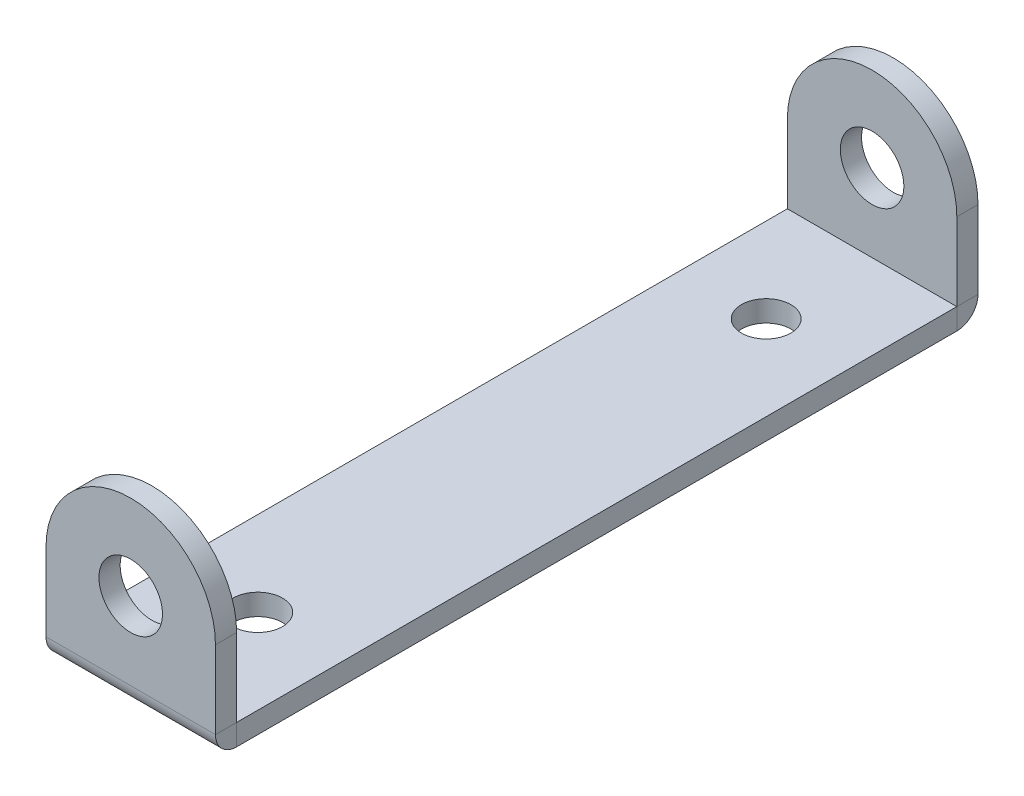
ISO-10303-21;
HEADER;
FILE_DESCRIPTION(('STEP AP214'),'2;1');
FILE_NAME('part.step','',(''),(''),'','','');
FILE_SCHEMA(('AUTOMOTIVE_DESIGN { 1 0 10303 214 1 1 1 1 }'));
ENDSEC;
DATA;
#1=APPLICATION_CONTEXT('core data for automotive mechanical design processes');
#2=APPLICATION_PROTOCOL_DEFINITION('international standard','automotive_design',2000,#1);
#3=PRODUCT_CONTEXT('',#1,'mechanical');
#4=PRODUCT('Part','Part','',(#3));
#5=PRODUCT_RELATED_PRODUCT_CATEGORY('part','',(#4));
#6=PRODUCT_DEFINITION_FORMATION('','',#4);
#7=PRODUCT_DEFINITION_CONTEXT('part definition',#1,'design');
#8=PRODUCT_DEFINITION('design','',#6,#7);
#9=PRODUCT_DEFINITION_SHAPE('','',#8);
#10=(LENGTH_UNIT() NAMED_UNIT(*) SI_UNIT(.MILLI.,.METRE.));
#11=(NAMED_UNIT(*) PLANE_ANGLE_UNIT() SI_UNIT($,.RADIAN.));
#12=(NAMED_UNIT(*) SI_UNIT($,.STERADIAN.) SOLID_ANGLE_UNIT());
#13=UNCERTAINTY_MEASURE_WITH_UNIT(LENGTH_MEASURE(1.E-05),#10,'distance_accuracy_value','');
#14=(GEOMETRIC_REPRESENTATION_CONTEXT(3) GLOBAL_UNCERTAINTY_ASSIGNED_CONTEXT((#13)) GLOBAL_UNIT_ASSIGNED_CONTEXT((#10,
#11,#12)) REPRESENTATION_CONTEXT('',''));
#15=CARTESIAN_POINT('',(0.,0.,0.));
#16=DIRECTION('',(0.,0.,1.));
#17=DIRECTION('',(1.,0.,0.));
#18=AXIS2_PLACEMENT_3D('',#15,#16,#17);
#19=CARTESIAN_POINT('',(0.,1.5,0.));
#20=DIRECTION('',(0.,1.,0.));
#21=DIRECTION('',(0.,0.,1.));
#22=AXIS2_PLACEMENT_3D('',#19,#20,#21);
#23=PLANE('',#22);
#24=CARTESIAN_POINT('',(0.,1.5,-16.));
#25=DIRECTION('',(0.,1.,0.));
#26=DIRECTION('',(0.,0.,1.));
#27=AXIS2_PLACEMENT_3D('',#24,#25,#26);
#28=CIRCLE('',#27,1.75);
#29=CARTESIAN_POINT('',(0.,1.5,-14.25));
#30=VERTEX_POINT('',#29);
#31=EDGE_CURVE('E204',#30,#30,#28,.T.);
#32=ORIENTED_EDGE('',*,*,#31,.F.);
#33=EDGE_LOOP('',(#32));
#34=FACE_BOUND('',#33,.T.);
#35=CARTESIAN_POINT('',(0.,1.5,-52.));
#36=DIRECTION('',(0.,1.,0.));
#37=DIRECTION('',(0.,0.,1.));
#38=AXIS2_PLACEMENT_3D('',#35,#36,#37);
#39=CIRCLE('',#38,1.75);
#40=CARTESIAN_POINT('',(0.,1.5,-50.25));
#41=VERTEX_POINT('',#40);
#42=EDGE_CURVE('E210',#41,#41,#39,.T.);
#43=ORIENTED_EDGE('',*,*,#42,.F.);
#44=EDGE_LOOP('',(#43));
#45=FACE_BOUND('',#44,.T.);
#46=DIRECTION('',(0.,0.,-1.));
#47=VECTOR('',#46,1.);
#48=CARTESIAN_POINT('',(6.,1.5,0.));
#49=LINE('',#48,#47);
#50=CARTESIAN_POINT('',(6.,1.5,-8.5));
#51=VERTEX_POINT('',#50);
#52=CARTESIAN_POINT('',(6.,1.5,-59.5));
#53=VERTEX_POINT('',#52);
#54=EDGE_CURVE('E44',#51,#53,#49,.T.);
#55=ORIENTED_EDGE('',*,*,#54,.T.);
#56=DIRECTION('',(-1.,0.,0.));
#57=VECTOR('',#56,1.);
#58=CARTESIAN_POINT('',(0.,1.5,-59.5));
#59=LINE('',#58,#57);
#60=CARTESIAN_POINT('',(-6.,1.5,-59.5));
#61=VERTEX_POINT('',#60);
#62=EDGE_CURVE('E224',#53,#61,#59,.T.);
#63=ORIENTED_EDGE('',*,*,#62,.T.);
#64=DIRECTION('',(0.,0.,1.));
#65=VECTOR('',#64,1.);
#66=CARTESIAN_POINT('',(-6.,1.5,0.));
#67=LINE('',#66,#65);
#68=CARTESIAN_POINT('',(-6.,1.5,-8.5));
#69=VERTEX_POINT('',#68);
#70=EDGE_CURVE('E217',#61,#69,#67,.T.);
#71=ORIENTED_EDGE('',*,*,#70,.T.);
#72=DIRECTION('',(-1.,0.,0.));
#73=VECTOR('',#72,1.);
#74=CARTESIAN_POINT('',(0.,1.5,-8.5));
#75=LINE('',#74,#73);
#76=EDGE_CURVE('E213',#51,#69,#75,.T.);
#77=ORIENTED_EDGE('',*,*,#76,.F.);
#78=EDGE_LOOP('',(#55,#63,#71,#77));
#79=FACE_BOUND('',#78,.T.);
#80=ADVANCED_FACE('F40',(#34,#45,#79),#23,.T.);
#81=CARTESIAN_POINT('',(-6.,1.5,0.));
#82=DIRECTION('',(1.,0.,0.));
#83=DIRECTION('',(0.,0.,-1.));
#84=AXIS2_PLACEMENT_3D('',#81,#82,#83);
#85=PLANE('',#84);
#86=DIRECTION('',(0.,1.,0.));
#87=VECTOR('',#86,1.);
#88=CARTESIAN_POINT('',(-6.,1.5,-59.5));
#89=LINE('',#88,#87);
#90=CARTESIAN_POINT('',(-6.,0.,-59.5));
#91=VERTEX_POINT('',#90);
#92=EDGE_CURVE('E12',#91,#61,#89,.T.);
#93=ORIENTED_EDGE('',*,*,#92,.F.);
#94=DIRECTION('',(0.,0.,1.));
#95=VECTOR('',#94,1.);
#96=CARTESIAN_POINT('',(-6.,0.,0.));
#97=LINE('',#96,#95);
#98=CARTESIAN_POINT('',(-6.,0.,-8.5));
#99=VERTEX_POINT('',#98);
#100=EDGE_CURVE('E57',#91,#99,#97,.T.);
#101=ORIENTED_EDGE('',*,*,#100,.T.);
#102=DIRECTION('',(0.,1.,0.));
#103=VECTOR('',#102,1.);
#104=CARTESIAN_POINT('',(-6.,1.5,-8.5));
#105=LINE('',#104,#103);
#106=EDGE_CURVE('E216',#99,#69,#105,.T.);
#107=ORIENTED_EDGE('',*,*,#106,.T.);
#108=ORIENTED_EDGE('',*,*,#70,.F.);
#109=EDGE_LOOP('',(#93,#101,#107,#108));
#110=FACE_BOUND('',#109,.T.);
#111=ADVANCED_FACE('F42',(#110),#85,.F.);
#112=CARTESIAN_POINT('',(6.,1.5,0.));
#113=DIRECTION('',(-1.,0.,0.));
#114=DIRECTION('',(0.,0.,1.));
#115=AXIS2_PLACEMENT_3D('',#112,#113,#114);
#116=PLANE('',#115);
#117=DIRECTION('',(0.,-1.,0.));
#118=VECTOR('',#117,1.);
#119=CARTESIAN_POINT('',(6.,1.5,-59.5));
#120=LINE('',#119,#118);
#121=CARTESIAN_POINT('',(6.,0.,-59.5));
#122=VERTEX_POINT('',#121);
#123=EDGE_CURVE('E227',#53,#122,#120,.T.);
#124=ORIENTED_EDGE('',*,*,#123,.F.);
#125=ORIENTED_EDGE('',*,*,#54,.F.);
#126=DIRECTION('',(0.,-1.,0.));
#127=VECTOR('',#126,1.);
#128=CARTESIAN_POINT('',(6.,1.5,-8.5));
#129=LINE('',#128,#127);
#130=CARTESIAN_POINT('',(6.,0.,-8.5));
#131=VERTEX_POINT('',#130);
#132=EDGE_CURVE('E222',#51,#131,#129,.T.);
#133=ORIENTED_EDGE('',*,*,#132,.T.);
#134=DIRECTION('',(0.,0.,-1.));
#135=VECTOR('',#134,1.);
#136=CARTESIAN_POINT('',(6.,0.,0.));
#137=LINE('',#136,#135);
#138=EDGE_CURVE('E65',#131,#122,#137,.T.);
#139=ORIENTED_EDGE('',*,*,#138,.T.);
#140=EDGE_LOOP('',(#124,#125,#133,#139));
#141=FACE_BOUND('',#140,.T.);
#142=ADVANCED_FACE('F238',(#141),#116,.F.);
#143=CARTESIAN_POINT('',(0.,0.,0.));
#144=DIRECTION('',(0.,1.,0.));
#145=DIRECTION('',(0.,0.,1.));
#146=AXIS2_PLACEMENT_3D('',#143,#144,#145);
#147=PLANE('',#146);
#148=DIRECTION('',(-1.,0.,0.));
#149=VECTOR('',#148,1.);
#150=CARTESIAN_POINT('',(0.,0.,-59.5));
#151=LINE('',#150,#149);
#152=EDGE_CURVE('E49',#122,#91,#151,.T.);
#153=ORIENTED_EDGE('',*,*,#152,.F.);
#154=ORIENTED_EDGE('',*,*,#138,.F.);
#155=DIRECTION('',(-1.,0.,0.));
#156=VECTOR('',#155,1.);
#157=CARTESIAN_POINT('',(0.,0.,-8.5));
#158=LINE('',#157,#156);
#159=EDGE_CURVE('E220',#131,#99,#158,.T.);
#160=ORIENTED_EDGE('',*,*,#159,.T.);
#161=ORIENTED_EDGE('',*,*,#100,.F.);
#162=EDGE_LOOP('',(#153,#154,#160,#161));
#163=FACE_BOUND('',#162,.T.);
#164=CARTESIAN_POINT('',(0.,0.,-16.));
#165=DIRECTION('',(0.,1.,0.));
#166=DIRECTION('',(0.,0.,1.));
#167=AXIS2_PLACEMENT_3D('',#164,#165,#166);
#168=CIRCLE('',#167,1.75);
#169=CARTESIAN_POINT('',(0.,0.,-14.25));
#170=VERTEX_POINT('',#169);
#171=EDGE_CURVE('E201',#170,#170,#168,.T.);
#172=ORIENTED_EDGE('',*,*,#171,.T.);
#173=EDGE_LOOP('',(#172));
#174=FACE_BOUND('',#173,.T.);
#175=CARTESIAN_POINT('',(0.,0.,-52.));
#176=DIRECTION('',(0.,1.,0.));
#177=DIRECTION('',(0.,0.,1.));
#178=AXIS2_PLACEMENT_3D('',#175,#176,#177);
#179=CIRCLE('',#178,1.75);
#180=CARTESIAN_POINT('',(0.,0.,-50.25));
#181=VERTEX_POINT('',#180);
#182=EDGE_CURVE('E207',#181,#181,#179,.T.);
#183=ORIENTED_EDGE('',*,*,#182,.T.);
#184=EDGE_LOOP('',(#183));
#185=FACE_BOUND('',#184,.T.);
#186=ADVANCED_FACE('F287',(#163,#174,#185),#147,.F.);
#187=CARTESIAN_POINT('',(0.,1.5,-52.));
#188=DIRECTION('',(0.,-1.,0.));
#189=DIRECTION('',(0.,0.,-1.));
#190=AXIS2_PLACEMENT_3D('',#187,#188,#189);
#191=CYLINDRICAL_SURFACE('',#190,1.75);
#192=ORIENTED_EDGE('',*,*,#42,.T.);
#193=EDGE_LOOP('',(#192));
#194=FACE_BOUND('',#193,.T.);
#195=ORIENTED_EDGE('',*,*,#182,.F.);
#196=EDGE_LOOP('',(#195));
#197=FACE_BOUND('',#196,.T.);
#198=ADVANCED_FACE('F310',(#194,#197),#191,.F.);
#199=CARTESIAN_POINT('',(0.,1.5,-16.));
#200=DIRECTION('',(0.,-1.,0.));
#201=DIRECTION('',(0.,0.,-1.));
#202=AXIS2_PLACEMENT_3D('',#199,#200,#201);
#203=CYLINDRICAL_SURFACE('',#202,1.75);
#204=ORIENTED_EDGE('',*,*,#31,.T.);
#205=EDGE_LOOP('',(#204));
#206=FACE_BOUND('',#205,.T.);
#207=ORIENTED_EDGE('',*,*,#171,.F.);
#208=EDGE_LOOP('',(#207));
#209=FACE_BOUND('',#208,.T.);
#210=ADVANCED_FACE('F317',(#206,#209),#203,.F.);
#211=CARTESIAN_POINT('',(-6.,1.5,-8.5));
#212=DIRECTION('',(-1.,0.,0.));
#213=DIRECTION('',(0.,0.,1.));
#214=AXIS2_PLACEMENT_3D('',#211,#212,#213);
#215=PLANE('',#214);
#216=CARTESIAN_POINT('',(-6.,1.5,-8.5));
#217=DIRECTION('',(1.,0.,0.));
#218=DIRECTION('',(0.,0.,-1.));
#219=AXIS2_PLACEMENT_3D('',#216,#217,#218);
#220=CIRCLE('',#219,1.5);
#221=CARTESIAN_POINT('',(-6.,1.5,-7.));
#222=VERTEX_POINT('',#221);
#223=EDGE_CURVE('E199',#222,#99,#220,.T.);
#224=ORIENTED_EDGE('',*,*,#223,.F.);
#225=DIRECTION('',(0.,0.,-1.));
#226=VECTOR('',#225,1.);
#227=CARTESIAN_POINT('',(-6.,1.5,-8.5));
#228=LINE('',#227,#226);
#229=EDGE_CURVE('E189',#222,#69,#228,.T.);
#230=ORIENTED_EDGE('',*,*,#229,.T.);
#231=ORIENTED_EDGE('',*,*,#106,.F.);
#232=EDGE_LOOP('',(#224,#230,#231));
#233=FACE_BOUND('',#232,.T.);
#234=ADVANCED_FACE('F269',(#233),#215,.T.);
#235=CARTESIAN_POINT('',(6.,1.5,-8.5));
#236=DIRECTION('',(1.,0.,0.));
#237=DIRECTION('',(0.,0.,-1.));
#238=AXIS2_PLACEMENT_3D('',#235,#236,#237);
#239=CYLINDRICAL_SURFACE('',#238,1.5);
#240=CARTESIAN_POINT('',(6.,1.5,-8.5));
#241=DIRECTION('',(1.,0.,0.));
#242=DIRECTION('',(0.,0.,-1.));
#243=AXIS2_PLACEMENT_3D('',#240,#241,#242);
#244=CIRCLE('',#243,1.5);
#245=CARTESIAN_POINT('',(6.,1.5,-7.));
#246=VERTEX_POINT('',#245);
#247=EDGE_CURVE('E164',#246,#131,#244,.T.);
#248=ORIENTED_EDGE('',*,*,#247,.F.);
#249=DIRECTION('',(-1.,0.,0.));
#250=VECTOR('',#249,1.);
#251=CARTESIAN_POINT('',(0.,1.5,-7.));
#252=LINE('',#251,#250);
#253=EDGE_CURVE('E192',#246,#222,#252,.T.);
#254=ORIENTED_EDGE('',*,*,#253,.T.);
#255=ORIENTED_EDGE('',*,*,#223,.T.);
#256=ORIENTED_EDGE('',*,*,#159,.F.);
#257=EDGE_LOOP('',(#248,#254,#255,#256));
#258=FACE_BOUND('',#257,.T.);
#259=ADVANCED_FACE('F330',(#258),#239,.T.);
#260=CARTESIAN_POINT('',(6.,1.5,-8.5));
#261=DIRECTION('',(1.,0.,0.));
#262=DIRECTION('',(0.,0.,-1.));
#263=AXIS2_PLACEMENT_3D('',#260,#261,#262);
#264=PLANE('',#263);
#265=DIRECTION('',(0.,0.,1.));
#266=VECTOR('',#265,1.);
#267=CARTESIAN_POINT('',(6.,1.5,-8.5));
#268=LINE('',#267,#266);
#269=EDGE_CURVE('E161',#51,#246,#268,.T.);
#270=ORIENTED_EDGE('',*,*,#269,.T.);
#271=ORIENTED_EDGE('',*,*,#247,.T.);
#272=ORIENTED_EDGE('',*,*,#132,.F.);
#273=EDGE_LOOP('',(#270,#271,#272));
#274=FACE_BOUND('',#273,.T.);
#275=ADVANCED_FACE('F284',(#274),#264,.T.);
#276=CARTESIAN_POINT('',(0.,7.00999999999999,-8.50000000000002));
#277=DIRECTION('',(0.,0.,1.));
#278=DIRECTION('',(0.,-1.,0.));
#279=AXIS2_PLACEMENT_3D('',#276,#277,#278);
#280=CYLINDRICAL_SURFACE('',#279,6.);
#281=CARTESIAN_POINT('',(0.,7.00999999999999,-7.00000000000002));
#282=DIRECTION('',(0.,0.,-1.));
#283=DIRECTION('',(0.,1.,0.));
#284=AXIS2_PLACEMENT_3D('',#281,#282,#283);
#285=CIRCLE('',#284,6.);
#286=CARTESIAN_POINT('',(-6.,7.00999999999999,-7.00000000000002));
#287=VERTEX_POINT('',#286);
#288=CARTESIAN_POINT('',(6.,7.00999999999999,-7.00000000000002));
#289=VERTEX_POINT('',#288);
#290=EDGE_CURVE('E186',#287,#289,#285,.T.);
#291=ORIENTED_EDGE('',*,*,#290,.T.);
#292=DIRECTION('',(0.,0.,1.));
#293=VECTOR('',#292,1.);
#294=CARTESIAN_POINT('',(6.,7.00999999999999,-8.50000000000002));
#295=LINE('',#294,#293);
#296=CARTESIAN_POINT('',(6.,7.00999999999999,-8.50000000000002));
#297=VERTEX_POINT('',#296);
#298=EDGE_CURVE('E165',#297,#289,#295,.T.);
#299=ORIENTED_EDGE('',*,*,#298,.F.);
#300=CARTESIAN_POINT('',(0.,7.00999999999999,-8.50000000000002));
#301=DIRECTION('',(0.,0.,-1.));
#302=DIRECTION('',(0.,1.,0.));
#303=AXIS2_PLACEMENT_3D('',#300,#301,#302);
#304=CIRCLE('',#303,6.);
#305=CARTESIAN_POINT('',(-6.,7.00999999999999,-8.50000000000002));
#306=VERTEX_POINT('',#305);
#307=EDGE_CURVE('E173',#306,#297,#304,.T.);
#308=ORIENTED_EDGE('',*,*,#307,.F.);
#309=DIRECTION('',(0.,0.,1.));
#310=VECTOR('',#309,1.);
#311=CARTESIAN_POINT('',(-6.,7.00999999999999,-8.50000000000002));
#312=LINE('',#311,#310);
#313=EDGE_CURVE('E183',#306,#287,#312,.T.);
#314=ORIENTED_EDGE('',*,*,#313,.T.);
#315=EDGE_LOOP('',(#291,#299,#308,#314));
#316=FACE_BOUND('',#315,.T.);
#317=ADVANCED_FACE('F338',(#316),#280,.T.);
#318=CARTESIAN_POINT('',(0.,7.00999999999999,-8.50000000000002));
#319=DIRECTION('',(0.,0.,1.));
#320=DIRECTION('',(0.,-1.,0.));
#321=AXIS2_PLACEMENT_3D('',#318,#319,#320);
#322=CYLINDRICAL_SURFACE('',#321,2.25);
#323=CARTESIAN_POINT('',(0.,7.00999999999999,-8.50000000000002));
#324=DIRECTION('',(0.,0.,-1.));
#325=DIRECTION('',(0.,1.,0.));
#326=AXIS2_PLACEMENT_3D('',#323,#324,#325);
#327=CIRCLE('',#326,2.25);
#328=CARTESIAN_POINT('',(0.,9.25999999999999,-8.50000000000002));
#329=VERTEX_POINT('',#328);
#330=EDGE_CURVE('E180',#329,#329,#327,.T.);
#331=ORIENTED_EDGE('',*,*,#330,.T.);
#332=EDGE_LOOP('',(#331));
#333=FACE_BOUND('',#332,.T.);
#334=CARTESIAN_POINT('',(0.,7.00999999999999,-7.00000000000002));
#335=DIRECTION('',(0.,0.,-1.));
#336=DIRECTION('',(0.,1.,0.));
#337=AXIS2_PLACEMENT_3D('',#334,#335,#336);
#338=CIRCLE('',#337,2.25);
#339=CARTESIAN_POINT('',(0.,9.25999999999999,-7.00000000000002));
#340=VERTEX_POINT('',#339);
#341=EDGE_CURVE('E168',#340,#340,#338,.T.);
#342=ORIENTED_EDGE('',*,*,#341,.F.);
#343=EDGE_LOOP('',(#342));
#344=FACE_BOUND('',#343,.T.);
#345=ADVANCED_FACE('F349',(#333,#344),#322,.F.);
#346=CARTESIAN_POINT('',(0.,7.00999999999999,-8.50000000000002));
#347=DIRECTION('',(0.,0.,-1.));
#348=DIRECTION('',(0.,1.,0.));
#349=AXIS2_PLACEMENT_3D('',#346,#347,#348);
#350=PLANE('',#349);
#351=ORIENTED_EDGE('',*,*,#330,.F.);
#352=EDGE_LOOP('',(#351));
#353=FACE_BOUND('',#352,.T.);
#354=DIRECTION('',(0.,-1.,0.));
#355=VECTOR('',#354,1.);
#356=CARTESIAN_POINT('',(6.,7.00999999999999,-8.50000000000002));
#357=LINE('',#356,#355);
#358=EDGE_CURVE('E178',#297,#51,#357,.T.);
#359=ORIENTED_EDGE('',*,*,#358,.T.);
#360=ORIENTED_EDGE('',*,*,#76,.T.);
#361=DIRECTION('',(0.,1.,0.));
#362=VECTOR('',#361,1.);
#363=CARTESIAN_POINT('',(-6.,7.00999999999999,-8.50000000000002));
#364=LINE('',#363,#362);
#365=EDGE_CURVE('E176',#69,#306,#364,.T.);
#366=ORIENTED_EDGE('',*,*,#365,.T.);
#367=ORIENTED_EDGE('',*,*,#307,.T.);
#368=EDGE_LOOP('',(#359,#360,#366,#367));
#369=FACE_BOUND('',#368,.T.);
#370=ADVANCED_FACE('F276',(#353,#369),#350,.T.);
#371=CARTESIAN_POINT('',(-6.,7.00999999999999,-8.50000000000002));
#372=DIRECTION('',(1.,0.,0.));
#373=DIRECTION('',(0.,-1.,0.));
#374=AXIS2_PLACEMENT_3D('',#371,#372,#373);
#375=PLANE('',#374);
#376=ORIENTED_EDGE('',*,*,#229,.F.);
#377=DIRECTION('',(0.,1.,0.));
#378=VECTOR('',#377,1.);
#379=CARTESIAN_POINT('',(-6.,7.00999999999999,-7.00000000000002));
#380=LINE('',#379,#378);
#381=EDGE_CURVE('E171',#222,#287,#380,.T.);
#382=ORIENTED_EDGE('',*,*,#381,.T.);
#383=ORIENTED_EDGE('',*,*,#313,.F.);
#384=ORIENTED_EDGE('',*,*,#365,.F.);
#385=EDGE_LOOP('',(#376,#382,#383,#384));
#386=FACE_BOUND('',#385,.T.);
#387=ADVANCED_FACE('F272',(#386),#375,.F.);
#388=CARTESIAN_POINT('',(0.,7.00999999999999,-7.00000000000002));
#389=DIRECTION('',(0.,0.,-1.));
#390=DIRECTION('',(0.,1.,0.));
#391=AXIS2_PLACEMENT_3D('',#388,#389,#390);
#392=PLANE('',#391);
#393=ORIENTED_EDGE('',*,*,#253,.F.);
#394=DIRECTION('',(0.,-1.,0.));
#395=VECTOR('',#394,1.);
#396=CARTESIAN_POINT('',(6.,7.00999999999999,-7.00000000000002));
#397=LINE('',#396,#395);
#398=EDGE_CURVE('E162',#289,#246,#397,.T.);
#399=ORIENTED_EDGE('',*,*,#398,.F.);
#400=ORIENTED_EDGE('',*,*,#290,.F.);
#401=ORIENTED_EDGE('',*,*,#381,.F.);
#402=EDGE_LOOP('',(#393,#399,#400,#401));
#403=FACE_BOUND('',#402,.T.);
#404=ORIENTED_EDGE('',*,*,#341,.T.);
#405=EDGE_LOOP('',(#404));
#406=FACE_BOUND('',#405,.T.);
#407=ADVANCED_FACE('F341',(#403,#406),#392,.F.);
#408=CARTESIAN_POINT('',(6.,7.00999999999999,-8.50000000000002));
#409=DIRECTION('',(-1.,0.,0.));
#410=DIRECTION('',(0.,1.,0.));
#411=AXIS2_PLACEMENT_3D('',#408,#409,#410);
#412=PLANE('',#411);
#413=ORIENTED_EDGE('',*,*,#269,.F.);
#414=ORIENTED_EDGE('',*,*,#358,.F.);
#415=ORIENTED_EDGE('',*,*,#298,.T.);
#416=ORIENTED_EDGE('',*,*,#398,.T.);
#417=EDGE_LOOP('',(#413,#414,#415,#416));
#418=FACE_BOUND('',#417,.T.);
#419=ADVANCED_FACE('F281',(#418),#412,.F.);
#420=CARTESIAN_POINT('',(6.,1.5,-59.5));
#421=DIRECTION('',(-1.,0.,0.));
#422=DIRECTION('',(0.,0.,1.));
#423=AXIS2_PLACEMENT_3D('',#420,#421,#422);
#424=PLANE('',#423);
#425=CARTESIAN_POINT('',(6.,1.5,-59.5));
#426=DIRECTION('',(-1.,0.,0.));
#427=DIRECTION('',(0.,0.,1.));
#428=AXIS2_PLACEMENT_3D('',#425,#426,#427);
#429=CIRCLE('',#428,1.5);
#430=CARTESIAN_POINT('',(6.,1.50000000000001,-61.));
#431=VERTEX_POINT('',#430);
#432=EDGE_CURVE('E157',#431,#122,#429,.T.);
#433=ORIENTED_EDGE('',*,*,#432,.F.);
#434=DIRECTION('',(0.,0.,-1.));
#435=VECTOR('',#434,1.);
#436=CARTESIAN_POINT('',(6.,1.5,-59.5));
#437=LINE('',#436,#435);
#438=EDGE_CURVE('E130',#53,#431,#437,.T.);
#439=ORIENTED_EDGE('',*,*,#438,.F.);
#440=ORIENTED_EDGE('',*,*,#123,.T.);
#441=EDGE_LOOP('',(#433,#439,#440));
#442=FACE_BOUND('',#441,.T.);
#443=ADVANCED_FACE('F241',(#442),#424,.F.);
#444=CARTESIAN_POINT('',(-6.,1.5,-59.5));
#445=DIRECTION('',(-1.,0.,0.));
#446=DIRECTION('',(0.,0.,1.));
#447=AXIS2_PLACEMENT_3D('',#444,#445,#446);
#448=CYLINDRICAL_SURFACE('',#447,1.5);
#449=CARTESIAN_POINT('',(-6.,1.5,-59.5));
#450=DIRECTION('',(-1.,0.,0.));
#451=DIRECTION('',(0.,0.,1.));
#452=AXIS2_PLACEMENT_3D('',#449,#450,#451);
#453=CIRCLE('',#452,1.5);
#454=CARTESIAN_POINT('',(-6.,1.50000000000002,-61.));
#455=VERTEX_POINT('',#454);
#456=EDGE_CURVE('E154',#455,#91,#453,.T.);
#457=ORIENTED_EDGE('',*,*,#456,.F.);
#458=DIRECTION('',(-1.,0.,0.));
#459=VECTOR('',#458,1.);
#460=CARTESIAN_POINT('',(0.,1.50000000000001,-61.));
#461=LINE('',#460,#459);
#462=EDGE_CURVE('E255',#431,#455,#461,.T.);
#463=ORIENTED_EDGE('',*,*,#462,.F.);
#464=ORIENTED_EDGE('',*,*,#432,.T.);
#465=ORIENTED_EDGE('',*,*,#152,.T.);
#466=EDGE_LOOP('',(#457,#463,#464,#465));
#467=FACE_BOUND('',#466,.T.);
#468=ADVANCED_FACE('F290',(#467),#448,.T.);
#469=CARTESIAN_POINT('',(-6.,1.5,-59.5));
#470=DIRECTION('',(1.,0.,0.));
#471=DIRECTION('',(0.,0.,-1.));
#472=AXIS2_PLACEMENT_3D('',#469,#470,#471);
#473=PLANE('',#472);
#474=DIRECTION('',(0.,0.,1.));
#475=VECTOR('',#474,1.);
#476=CARTESIAN_POINT('',(-6.,1.5,-59.5));
#477=LINE('',#476,#475);
#478=EDGE_CURVE('E258',#455,#61,#477,.T.);
#479=ORIENTED_EDGE('',*,*,#478,.F.);
#480=ORIENTED_EDGE('',*,*,#456,.T.);
#481=ORIENTED_EDGE('',*,*,#92,.T.);
#482=EDGE_LOOP('',(#479,#480,#481));
#483=FACE_BOUND('',#482,.T.);
#484=ADVANCED_FACE('F264',(#483),#473,.F.);
#485=CARTESIAN_POINT('',(0.,7.01,-59.5));
#486=DIRECTION('',(0.,0.,-1.));
#487=DIRECTION('',(0.,1.,0.));
#488=AXIS2_PLACEMENT_3D('',#485,#486,#487);
#489=CYLINDRICAL_SURFACE('',#488,2.25);
#490=CARTESIAN_POINT('',(0.,7.01,-59.5));
#491=DIRECTION('',(0.,0.,1.));
#492=DIRECTION('',(0.,-1.,0.));
#493=AXIS2_PLACEMENT_3D('',#490,#491,#492);
#494=CIRCLE('',#493,2.25);
#495=CARTESIAN_POINT('',(0.,4.76,-59.5));
#496=VERTEX_POINT('',#495);
#497=EDGE_CURVE('E148',#496,#496,#494,.T.);
#498=ORIENTED_EDGE('',*,*,#497,.T.);
#499=EDGE_LOOP('',(#498));
#500=FACE_BOUND('',#499,.T.);
#501=CARTESIAN_POINT('',(0.,7.01,-61.));
#502=DIRECTION('',(0.,0.,1.));
#503=DIRECTION('',(0.,-1.,0.));
#504=AXIS2_PLACEMENT_3D('',#501,#502,#503);
#505=CIRCLE('',#504,2.25);
#506=CARTESIAN_POINT('',(0.,4.76,-61.));
#507=VERTEX_POINT('',#506);
#508=EDGE_CURVE('E134',#507,#507,#505,.T.);
#509=ORIENTED_EDGE('',*,*,#508,.F.);
#510=EDGE_LOOP('',(#509));
#511=FACE_BOUND('',#510,.T.);
#512=ADVANCED_FACE('F297',(#500,#511),#489,.F.);
#513=CARTESIAN_POINT('',(0.,7.01,-59.5));
#514=DIRECTION('',(0.,0.,-1.));
#515=DIRECTION('',(0.,1.,0.));
#516=AXIS2_PLACEMENT_3D('',#513,#514,#515);
#517=CYLINDRICAL_SURFACE('',#516,6.);
#518=CARTESIAN_POINT('',(0.,7.01,-61.));
#519=DIRECTION('',(0.,0.,1.));
#520=DIRECTION('',(0.,-1.,0.));
#521=AXIS2_PLACEMENT_3D('',#518,#519,#520);
#522=CIRCLE('',#521,6.);
#523=CARTESIAN_POINT('',(6.,7.01,-61.));
#524=VERTEX_POINT('',#523);
#525=CARTESIAN_POINT('',(-6.,7.01,-61.));
#526=VERTEX_POINT('',#525);
#527=EDGE_CURVE('E139',#524,#526,#522,.T.);
#528=ORIENTED_EDGE('',*,*,#527,.T.);
#529=DIRECTION('',(0.,0.,-1.));
#530=VECTOR('',#529,1.);
#531=CARTESIAN_POINT('',(-6.,7.01,-59.5));
#532=LINE('',#531,#530);
#533=CARTESIAN_POINT('',(-6.,7.01,-59.5));
#534=VERTEX_POINT('',#533);
#535=EDGE_CURVE('E158',#534,#526,#532,.T.);
#536=ORIENTED_EDGE('',*,*,#535,.F.);
#537=CARTESIAN_POINT('',(0.,7.01,-59.5));
#538=DIRECTION('',(0.,0.,1.));
#539=DIRECTION('',(0.,-1.,0.));
#540=AXIS2_PLACEMENT_3D('',#537,#538,#539);
#541=CIRCLE('',#540,6.);
#542=CARTESIAN_POINT('',(6.,7.01,-59.5));
#543=VERTEX_POINT('',#542);
#544=EDGE_CURVE('E141',#543,#534,#541,.T.);
#545=ORIENTED_EDGE('',*,*,#544,.F.);
#546=DIRECTION('',(0.,0.,-1.));
#547=VECTOR('',#546,1.);
#548=CARTESIAN_POINT('',(6.,7.01,-59.5));
#549=LINE('',#548,#547);
#550=EDGE_CURVE('E127',#543,#524,#549,.T.);
#551=ORIENTED_EDGE('',*,*,#550,.T.);
#552=EDGE_LOOP('',(#528,#536,#545,#551));
#553=FACE_BOUND('',#552,.T.);
#554=ADVANCED_FACE('F137',(#553),#517,.T.);
#555=CARTESIAN_POINT('',(0.,-60.99,-59.5000000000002));
#556=DIRECTION('',(0.,0.,1.));
#557=DIRECTION('',(0.,-1.,0.));
#558=AXIS2_PLACEMENT_3D('',#555,#556,#557);
#559=PLANE('',#558);
#560=ORIENTED_EDGE('',*,*,#62,.F.);
#561=DIRECTION('',(0.,1.,0.));
#562=VECTOR('',#561,1.);
#563=CARTESIAN_POINT('',(6.,-60.99,-59.5000000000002));
#564=LINE('',#563,#562);
#565=EDGE_CURVE('E142',#53,#543,#564,.T.);
#566=ORIENTED_EDGE('',*,*,#565,.T.);
#567=ORIENTED_EDGE('',*,*,#544,.T.);
#568=DIRECTION('',(0.,-1.,0.));
#569=VECTOR('',#568,1.);
#570=CARTESIAN_POINT('',(-6.,-60.99,-59.5000000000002));
#571=LINE('',#570,#569);
#572=EDGE_CURVE('E242',#534,#61,#571,.T.);
#573=ORIENTED_EDGE('',*,*,#572,.T.);
#574=EDGE_LOOP('',(#560,#566,#567,#573));
#575=FACE_BOUND('',#574,.T.);
#576=ORIENTED_EDGE('',*,*,#497,.F.);
#577=EDGE_LOOP('',(#576));
#578=FACE_BOUND('',#577,.T.);
#579=ADVANCED_FACE('F246',(#575,#578),#559,.T.);
#580=CARTESIAN_POINT('',(6.,-60.99,-59.5000000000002));
#581=DIRECTION('',(-1.,0.,0.));
#582=DIRECTION('',(0.,-1.,0.));
#583=AXIS2_PLACEMENT_3D('',#580,#581,#582);
#584=PLANE('',#583);
#585=ORIENTED_EDGE('',*,*,#565,.F.);
#586=ORIENTED_EDGE('',*,*,#438,.T.);
#587=DIRECTION('',(0.,1.,0.));
#588=VECTOR('',#587,1.);
#589=CARTESIAN_POINT('',(6.,-60.99,-61.0000000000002));
#590=LINE('',#589,#588);
#591=EDGE_CURVE('E123',#431,#524,#590,.T.);
#592=ORIENTED_EDGE('',*,*,#591,.T.);
#593=ORIENTED_EDGE('',*,*,#550,.F.);
#594=EDGE_LOOP('',(#585,#586,#592,#593));
#595=FACE_BOUND('',#594,.T.);
#596=ADVANCED_FACE('F126',(#595),#584,.F.);
#597=CARTESIAN_POINT('',(0.,-60.99,-61.0000000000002));
#598=DIRECTION('',(0.,0.,1.));
#599=DIRECTION('',(0.,-1.,0.));
#600=AXIS2_PLACEMENT_3D('',#597,#598,#599);
#601=PLANE('',#600);
#602=ORIENTED_EDGE('',*,*,#508,.T.);
#603=EDGE_LOOP('',(#602));
#604=FACE_BOUND('',#603,.T.);
#605=ORIENTED_EDGE('',*,*,#591,.F.);
#606=ORIENTED_EDGE('',*,*,#462,.T.);
#607=DIRECTION('',(0.,-1.,0.));
#608=VECTOR('',#607,1.);
#609=CARTESIAN_POINT('',(-6.,-60.99,-61.0000000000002));
#610=LINE('',#609,#608);
#611=EDGE_CURVE('E147',#526,#455,#610,.T.);
#612=ORIENTED_EDGE('',*,*,#611,.F.);
#613=ORIENTED_EDGE('',*,*,#527,.F.);
#614=EDGE_LOOP('',(#605,#606,#612,#613));
#615=FACE_BOUND('',#614,.T.);
#616=ADVANCED_FACE('F145',(#604,#615),#601,.F.);
#617=CARTESIAN_POINT('',(-6.,-60.99,-59.5000000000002));
#618=DIRECTION('',(1.,0.,0.));
#619=DIRECTION('',(0.,1.,0.));
#620=AXIS2_PLACEMENT_3D('',#617,#618,#619);
#621=PLANE('',#620);
#622=ORIENTED_EDGE('',*,*,#611,.T.);
#623=ORIENTED_EDGE('',*,*,#478,.T.);
#624=ORIENTED_EDGE('',*,*,#572,.F.);
#625=ORIENTED_EDGE('',*,*,#535,.T.);
#626=EDGE_LOOP('',(#622,#623,#624,#625));
#627=FACE_BOUND('',#626,.T.);
#628=ADVANCED_FACE('F261',(#627),#621,.F.);
#629=CLOSED_SHELL('',(#80,#111,#142,#186,#198,#210,#234,#259,#275,#317,#345,#370,#387,#407,#419,
#443,#468,#484,#512,#554,#579,#596,#616,#628));
#630=MANIFOLD_SOLID_BREP('B2',#629);
#631=ADVANCED_BREP_SHAPE_REPRESENTATION('',(#18,#630),#14);
#632=SHAPE_DEFINITION_REPRESENTATION(#9,#631);
ENDSEC;
END-ISO-10303-21;
